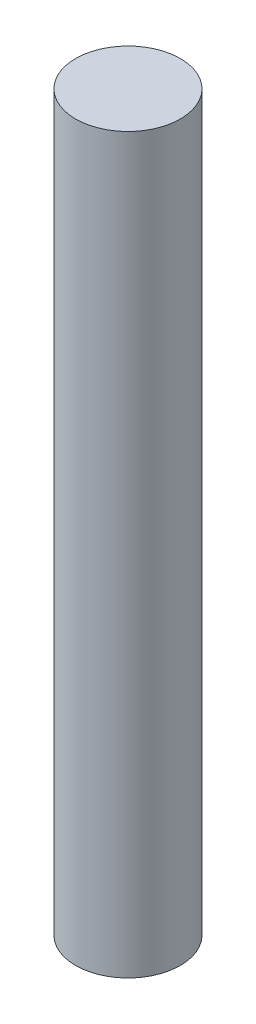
ISO-10303-21;
HEADER;
FILE_DESCRIPTION(('STEP AP214'),'2;1');
FILE_NAME('part.step','',(''),(''),'','','');
FILE_SCHEMA(('AUTOMOTIVE_DESIGN { 1 0 10303 214 1 1 1 1 }'));
ENDSEC;
DATA;
#1=APPLICATION_CONTEXT('core data for automotive mechanical design processes');
#2=APPLICATION_PROTOCOL_DEFINITION('international standard','automotive_design',2000,#1);
#3=PRODUCT_CONTEXT('',#1,'mechanical');
#4=PRODUCT('Part','Part','',(#3));
#5=PRODUCT_RELATED_PRODUCT_CATEGORY('part','',(#4));
#6=PRODUCT_DEFINITION_FORMATION('','',#4);
#7=PRODUCT_DEFINITION_CONTEXT('part definition',#1,'design');
#8=PRODUCT_DEFINITION('design','',#6,#7);
#9=PRODUCT_DEFINITION_SHAPE('','',#8);
#10=(LENGTH_UNIT() NAMED_UNIT(*) SI_UNIT(.MILLI.,.METRE.));
#11=(NAMED_UNIT(*) PLANE_ANGLE_UNIT() SI_UNIT($,.RADIAN.));
#12=(NAMED_UNIT(*) SI_UNIT($,.STERADIAN.) SOLID_ANGLE_UNIT());
#13=UNCERTAINTY_MEASURE_WITH_UNIT(LENGTH_MEASURE(1.E-05),#10,'distance_accuracy_value','');
#14=(GEOMETRIC_REPRESENTATION_CONTEXT(3) GLOBAL_UNCERTAINTY_ASSIGNED_CONTEXT((#13)) GLOBAL_UNIT_ASSIGNED_CONTEXT((#10,
#11,#12)) REPRESENTATION_CONTEXT('',''));
#15=CARTESIAN_POINT('',(0.,0.,0.));
#16=DIRECTION('',(0.,0.,1.));
#17=DIRECTION('',(1.,0.,0.));
#18=AXIS2_PLACEMENT_3D('',#15,#16,#17);
#19=CARTESIAN_POINT('',(0.,66.675,0.));
#20=DIRECTION('',(0.,-1.,0.));
#21=DIRECTION('',(0.,0.,-1.));
#22=AXIS2_PLACEMENT_3D('',#19,#20,#21);
#23=CYLINDRICAL_SURFACE('',#22,4.7625);
#24=CARTESIAN_POINT('',(0.,66.675,0.));
#25=DIRECTION('',(0.,1.,0.));
#26=DIRECTION('',(0.,0.,1.));
#27=AXIS2_PLACEMENT_3D('',#24,#25,#26);
#28=CIRCLE('',#27,4.7625);
#29=CARTESIAN_POINT('',(0.,66.675,4.7625));
#30=VERTEX_POINT('',#29);
#31=EDGE_CURVE('E10',#30,#30,#28,.T.);
#32=ORIENTED_EDGE('',*,*,#31,.F.);
#33=EDGE_LOOP('',(#32));
#34=FACE_BOUND('',#33,.T.);
#35=CARTESIAN_POINT('',(0.,0.,0.));
#36=DIRECTION('',(0.,1.,0.));
#37=DIRECTION('',(0.,0.,1.));
#38=AXIS2_PLACEMENT_3D('',#35,#36,#37);
#39=CIRCLE('',#38,4.7625);
#40=CARTESIAN_POINT('',(0.,0.,4.7625));
#41=VERTEX_POINT('',#40);
#42=EDGE_CURVE('E32',#41,#41,#39,.T.);
#43=ORIENTED_EDGE('',*,*,#42,.T.);
#44=EDGE_LOOP('',(#43));
#45=FACE_BOUND('',#44,.T.);
#46=ADVANCED_FACE('F29',(#34,#45),#23,.T.);
#47=CARTESIAN_POINT('',(0.,66.675,0.));
#48=DIRECTION('',(0.,1.,0.));
#49=DIRECTION('',(0.,0.,1.));
#50=AXIS2_PLACEMENT_3D('',#47,#48,#49);
#51=PLANE('',#50);
#52=ORIENTED_EDGE('',*,*,#31,.T.);
#53=EDGE_LOOP('',(#52));
#54=FACE_BOUND('',#53,.T.);
#55=ADVANCED_FACE('F44',(#54),#51,.T.);
#56=CARTESIAN_POINT('',(0.,0.,0.));
#57=DIRECTION('',(0.,1.,0.));
#58=DIRECTION('',(0.,0.,1.));
#59=AXIS2_PLACEMENT_3D('',#56,#57,#58);
#60=PLANE('',#59);
#61=ORIENTED_EDGE('',*,*,#42,.F.);
#62=EDGE_LOOP('',(#61));
#63=FACE_BOUND('',#62,.T.);
#64=ADVANCED_FACE('F42',(#63),#60,.F.);
#65=CLOSED_SHELL('',(#46,#55,#64));
#66=MANIFOLD_SOLID_BREP('B2',#65);
#67=ADVANCED_BREP_SHAPE_REPRESENTATION('',(#18,#66),#14);
#68=SHAPE_DEFINITION_REPRESENTATION(#9,#67);
ENDSEC;
END-ISO-10303-21;
